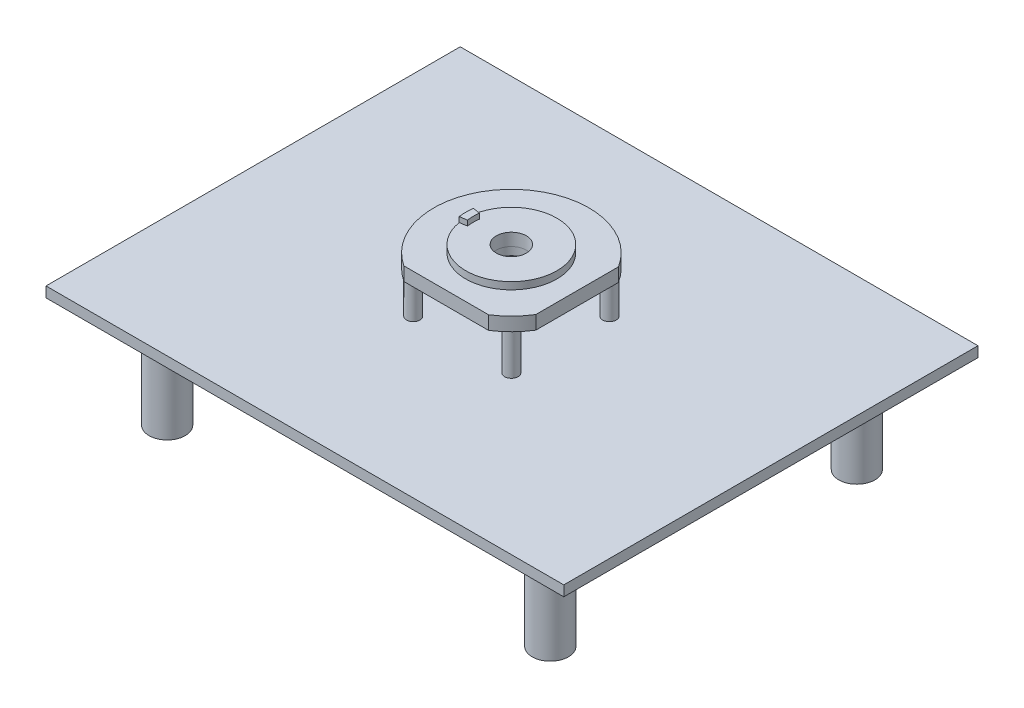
ISO-10303-21;
HEADER;
FILE_DESCRIPTION(('STEP AP214'),'2;1');
FILE_NAME('part.step','',(''),(''),'','','');
FILE_SCHEMA(('AUTOMOTIVE_DESIGN { 1 0 10303 214 1 1 1 1 }'));
ENDSEC;
DATA;
#1=APPLICATION_CONTEXT('core data for automotive mechanical design processes');
#2=APPLICATION_PROTOCOL_DEFINITION('international standard','automotive_design',2000,#1);
#3=PRODUCT_CONTEXT('',#1,'mechanical');
#4=PRODUCT('Part','Part','',(#3));
#5=PRODUCT_RELATED_PRODUCT_CATEGORY('part','',(#4));
#6=PRODUCT_DEFINITION_FORMATION('','',#4);
#7=PRODUCT_DEFINITION_CONTEXT('part definition',#1,'design');
#8=PRODUCT_DEFINITION('design','',#6,#7);
#9=PRODUCT_DEFINITION_SHAPE('','',#8);
#10=(LENGTH_UNIT() NAMED_UNIT(*) SI_UNIT(.MILLI.,.METRE.));
#11=(NAMED_UNIT(*) PLANE_ANGLE_UNIT() SI_UNIT($,.RADIAN.));
#12=(NAMED_UNIT(*) SI_UNIT($,.STERADIAN.) SOLID_ANGLE_UNIT());
#13=UNCERTAINTY_MEASURE_WITH_UNIT(LENGTH_MEASURE(1.E-05),#10,'distance_accuracy_value','');
#14=(GEOMETRIC_REPRESENTATION_CONTEXT(3) GLOBAL_UNCERTAINTY_ASSIGNED_CONTEXT((#13)) GLOBAL_UNIT_ASSIGNED_CONTEXT((#10,
#11,#12)) REPRESENTATION_CONTEXT('',''));
#15=CARTESIAN_POINT('',(0.,0.,0.));
#16=DIRECTION('',(0.,0.,1.));
#17=DIRECTION('',(1.,0.,0.));
#18=AXIS2_PLACEMENT_3D('',#15,#16,#17);
#19=CARTESIAN_POINT('',(0.,50.,0.623845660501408));
#20=DIRECTION('',(0.,1.,0.));
#21=DIRECTION('',(-1.,0.,0.));
#22=AXIS2_PLACEMENT_3D('',#19,#20,#21);
#23=CYLINDRICAL_SURFACE('',#22,75.);
#24=CARTESIAN_POINT('',(0.,50.,0.623845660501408));
#25=DIRECTION('',(0.,-1.,0.));
#26=DIRECTION('',(1.,0.,0.));
#27=AXIS2_PLACEMENT_3D('',#24,#25,#26);
#28=CIRCLE('',#27,75.);
#29=CARTESIAN_POINT('',(63.5,50.,40.5331177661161));
#30=VERTEX_POINT('',#29);
#31=CARTESIAN_POINT('',(40.8850732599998,50.,63.5));
#32=VERTEX_POINT('',#31);
#33=EDGE_CURVE('E195',#30,#32,#28,.T.);
#34=ORIENTED_EDGE('',*,*,#33,.F.);
#35=DIRECTION('',(0.,1.,0.));
#36=VECTOR('',#35,1.);
#37=CARTESIAN_POINT('',(63.5,50.,40.5331177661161));
#38=LINE('',#37,#36);
#39=CARTESIAN_POINT('',(63.5,63.08,40.5331177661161));
#40=VERTEX_POINT('',#39);
#41=EDGE_CURVE('E56',#30,#40,#38,.T.);
#42=ORIENTED_EDGE('',*,*,#41,.T.);
#43=CARTESIAN_POINT('',(0.,63.08,0.623845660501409));
#44=DIRECTION('',(0.,-1.,0.));
#45=DIRECTION('',(0.,0.,-1.));
#46=AXIS2_PLACEMENT_3D('',#43,#44,#45);
#47=CIRCLE('',#46,75.);
#48=CARTESIAN_POINT('',(40.8850732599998,63.08,63.5));
#49=VERTEX_POINT('',#48);
#50=EDGE_CURVE('E194',#40,#49,#47,.T.);
#51=ORIENTED_EDGE('',*,*,#50,.T.);
#52=DIRECTION('',(0.,1.,0.));
#53=VECTOR('',#52,1.);
#54=CARTESIAN_POINT('',(40.8850732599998,50.,63.5));
#55=LINE('',#54,#53);
#56=EDGE_CURVE('E301',#49,#32,#55,.F.);
#57=ORIENTED_EDGE('',*,*,#56,.T.);
#58=EDGE_LOOP('',(#34,#42,#51,#57));
#59=FACE_BOUND('',#58,.T.);
#60=ADVANCED_FACE('F38',(#59),#23,.T.);
#61=CARTESIAN_POINT('',(14.5,58.,0.623845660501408));
#62=DIRECTION('',(0.,-1.,0.));
#63=DIRECTION('',(0.,0.,-1.));
#64=AXIS2_PLACEMENT_3D('',#61,#62,#63);
#65=PLANE('',#64);
#66=CARTESIAN_POINT('',(0.,58.,0.623845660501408));
#67=DIRECTION('',(0.,-1.,0.));
#68=DIRECTION('',(0.,0.,-1.));
#69=AXIS2_PLACEMENT_3D('',#66,#67,#68);
#70=CIRCLE('',#69,14.5);
#71=CARTESIAN_POINT('',(0.,58.,-13.8761543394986));
#72=VERTEX_POINT('',#71);
#73=EDGE_CURVE('E158',#72,#72,#70,.T.);
#74=ORIENTED_EDGE('',*,*,#73,.F.);
#75=EDGE_LOOP('',(#74));
#76=FACE_BOUND('',#75,.T.);
#77=CARTESIAN_POINT('',(0.,58.,0.623845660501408));
#78=DIRECTION('',(0.,1.,0.));
#79=DIRECTION('',(-1.,0.,0.));
#80=AXIS2_PLACEMENT_3D('',#77,#78,#79);
#81=CIRCLE('',#80,15.);
#82=CARTESIAN_POINT('',(-15.,58.,0.623845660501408));
#83=VERTEX_POINT('',#82);
#84=EDGE_CURVE('E178',#83,#83,#81,.T.);
#85=ORIENTED_EDGE('',*,*,#84,.F.);
#86=EDGE_LOOP('',(#85));
#87=FACE_BOUND('',#86,.T.);
#88=ADVANCED_FACE('F337',(#76,#87),#65,.T.);
#89=CARTESIAN_POINT('',(0.,58.,0.623845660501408));
#90=DIRECTION('',(0.,-1.,0.));
#91=DIRECTION('',(0.,0.,-1.));
#92=AXIS2_PLACEMENT_3D('',#89,#90,#91);
#93=CYLINDRICAL_SURFACE('',#92,44.);
#94=CARTESIAN_POINT('',(0.,70.,0.623845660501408));
#95=DIRECTION('',(0.,-1.,0.));
#96=DIRECTION('',(0.,0.,-1.));
#97=AXIS2_PLACEMENT_3D('',#94,#95,#96);
#98=CIRCLE('',#97,44.);
#99=CARTESIAN_POINT('',(-43.458286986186,70.,-6.25927080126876));
#100=VERTEX_POINT('',#99);
#101=CARTESIAN_POINT('',(-43.458286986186,70.,7.50696212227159));
#102=VERTEX_POINT('',#101);
#103=EDGE_CURVE('E138',#100,#102,#98,.T.);
#104=ORIENTED_EDGE('',*,*,#103,.T.);
#105=DIRECTION('',(0.,-1.,0.));
#106=VECTOR('',#105,1.);
#107=CARTESIAN_POINT('',(-43.458286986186,75.,7.50696212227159));
#108=LINE('',#107,#106);
#109=CARTESIAN_POINT('',(-43.458286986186,75.,7.50696212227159));
#110=VERTEX_POINT('',#109);
#111=EDGE_CURVE('E128',#110,#102,#108,.T.);
#112=ORIENTED_EDGE('',*,*,#111,.F.);
#113=CARTESIAN_POINT('',(0.,75.,0.623845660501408));
#114=DIRECTION('',(0.,1.,0.));
#115=DIRECTION('',(0.,0.,1.));
#116=AXIS2_PLACEMENT_3D('',#113,#114,#115);
#117=CIRCLE('',#116,44.);
#118=CARTESIAN_POINT('',(-43.458286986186,75.,-6.25927080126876));
#119=VERTEX_POINT('',#118);
#120=EDGE_CURVE('E279',#119,#110,#117,.T.);
#121=ORIENTED_EDGE('',*,*,#120,.F.);
#122=DIRECTION('',(0.,-1.,0.));
#123=VECTOR('',#122,1.);
#124=CARTESIAN_POINT('',(-43.458286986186,75.,-6.25927080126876));
#125=LINE('',#124,#123);
#126=EDGE_CURVE('E154',#119,#100,#125,.T.);
#127=ORIENTED_EDGE('',*,*,#126,.T.);
#128=EDGE_LOOP('',(#104,#112,#121,#127));
#129=FACE_BOUND('',#128,.T.);
#130=CARTESIAN_POINT('',(0.,63.08,0.623845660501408));
#131=DIRECTION('',(0.,-1.,0.));
#132=DIRECTION('',(0.,0.,-1.));
#133=AXIS2_PLACEMENT_3D('',#130,#131,#132);
#134=CIRCLE('',#133,44.);
#135=CARTESIAN_POINT('',(0.,63.08,-43.3761543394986));
#136=VERTEX_POINT('',#135);
#137=EDGE_CURVE('E42',#136,#136,#134,.T.);
#138=ORIENTED_EDGE('',*,*,#137,.F.);
#139=EDGE_LOOP('',(#138));
#140=FACE_BOUND('',#139,.T.);
#141=ADVANCED_FACE('F151',(#129,#140),#93,.T.);
#142=CARTESIAN_POINT('',(0.,58.,0.623845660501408));
#143=DIRECTION('',(0.,-1.,0.));
#144=DIRECTION('',(0.,0.,-1.));
#145=AXIS2_PLACEMENT_3D('',#142,#143,#144);
#146=CYLINDRICAL_SURFACE('',#145,14.5);
#147=ORIENTED_EDGE('',*,*,#73,.T.);
#148=EDGE_LOOP('',(#147));
#149=FACE_BOUND('',#148,.T.);
#150=CARTESIAN_POINT('',(0.,70.,0.623845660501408));
#151=DIRECTION('',(0.,-1.,0.));
#152=DIRECTION('',(0.,0.,-1.));
#153=AXIS2_PLACEMENT_3D('',#150,#151,#152);
#154=CIRCLE('',#153,14.5);
#155=CARTESIAN_POINT('',(0.,70.,-13.8761543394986));
#156=VERTEX_POINT('',#155);
#157=EDGE_CURVE('E155',#156,#156,#154,.T.);
#158=ORIENTED_EDGE('',*,*,#157,.F.);
#159=EDGE_LOOP('',(#158));
#160=FACE_BOUND('',#159,.T.);
#161=ADVANCED_FACE('F453',(#149,#160),#146,.F.);
#162=CARTESIAN_POINT('',(14.5,70.,0.623845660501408));
#163=DIRECTION('',(0.,1.,0.));
#164=DIRECTION('',(0.,0.,1.));
#165=AXIS2_PLACEMENT_3D('',#162,#163,#164);
#166=PLANE('',#165);
#167=DIRECTION('',(-0.987688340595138,0.,-0.156434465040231));
#168=VECTOR('',#167,1.);
#169=CARTESIAN_POINT('',(0.,70.,0.623845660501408));
#170=LINE('',#169,#168);
#171=CARTESIAN_POINT('',(-36.5444686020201,70.,-5.16422954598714));
#172=VERTEX_POINT('',#171);
#173=EDGE_CURVE('E171',#172,#100,#170,.T.);
#174=ORIENTED_EDGE('',*,*,#173,.F.);
#175=CARTESIAN_POINT('',(0.,70.,0.623845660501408));
#176=DIRECTION('',(0.,1.,0.));
#177=DIRECTION('',(0.,0.,1.));
#178=AXIS2_PLACEMENT_3D('',#175,#176,#177);
#179=CIRCLE('',#178,37.);
#180=CARTESIAN_POINT('',(-36.5444686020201,70.,6.41192086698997));
#181=VERTEX_POINT('',#180);
#182=EDGE_CURVE('E147',#172,#181,#179,.T.);
#183=ORIENTED_EDGE('',*,*,#182,.T.);
#184=DIRECTION('',(-0.987688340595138,0.,0.156434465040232));
#185=VECTOR('',#184,1.);
#186=CARTESIAN_POINT('',(0.,70.,0.623845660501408));
#187=LINE('',#186,#185);
#188=EDGE_CURVE('E131',#181,#102,#187,.T.);
#189=ORIENTED_EDGE('',*,*,#188,.T.);
#190=ORIENTED_EDGE('',*,*,#103,.F.);
#191=EDGE_LOOP('',(#174,#183,#189,#190));
#192=FACE_BOUND('',#191,.T.);
#193=ORIENTED_EDGE('',*,*,#157,.T.);
#194=EDGE_LOOP('',(#193));
#195=FACE_BOUND('',#194,.T.);
#196=ADVANCED_FACE('F144',(#192,#195),#166,.T.);
#197=CARTESIAN_POINT('',(0.,75.,0.623845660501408));
#198=DIRECTION('',(0.156434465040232,0.,0.987688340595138));
#199=DIRECTION('',(0.987688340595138,0.,-0.156434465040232));
#200=AXIS2_PLACEMENT_3D('',#197,#198,#199);
#201=PLANE('',#200);
#202=ORIENTED_EDGE('',*,*,#188,.F.);
#203=DIRECTION('',(0.,-1.,0.));
#204=VECTOR('',#203,1.);
#205=CARTESIAN_POINT('',(-36.5444686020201,75.,6.41192086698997));
#206=LINE('',#205,#204);
#207=CARTESIAN_POINT('',(-36.5444686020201,75.,6.41192086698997));
#208=VERTEX_POINT('',#207);
#209=EDGE_CURVE('E139',#208,#181,#206,.T.);
#210=ORIENTED_EDGE('',*,*,#209,.F.);
#211=DIRECTION('',(-0.987688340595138,0.,0.156434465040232));
#212=VECTOR('',#211,1.);
#213=CARTESIAN_POINT('',(0.,75.,0.623845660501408));
#214=LINE('',#213,#212);
#215=EDGE_CURVE('E134',#208,#110,#214,.T.);
#216=ORIENTED_EDGE('',*,*,#215,.T.);
#217=ORIENTED_EDGE('',*,*,#111,.T.);
#218=EDGE_LOOP('',(#202,#210,#216,#217));
#219=FACE_BOUND('',#218,.T.);
#220=ADVANCED_FACE('F130',(#219),#201,.T.);
#221=CARTESIAN_POINT('',(0.,75.,0.623845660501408));
#222=DIRECTION('',(0.,-1.,0.));
#223=DIRECTION('',(0.,0.,-1.));
#224=AXIS2_PLACEMENT_3D('',#221,#222,#223);
#225=CYLINDRICAL_SURFACE('',#224,37.);
#226=ORIENTED_EDGE('',*,*,#182,.F.);
#227=DIRECTION('',(0.,-1.,0.));
#228=VECTOR('',#227,1.);
#229=CARTESIAN_POINT('',(-36.5444686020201,75.,-5.16422954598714));
#230=LINE('',#229,#228);
#231=CARTESIAN_POINT('',(-36.5444686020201,75.,-5.16422954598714));
#232=VERTEX_POINT('',#231);
#233=EDGE_CURVE('E172',#232,#172,#230,.T.);
#234=ORIENTED_EDGE('',*,*,#233,.F.);
#235=CARTESIAN_POINT('',(0.,75.,0.623845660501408));
#236=DIRECTION('',(0.,1.,0.));
#237=DIRECTION('',(0.,0.,1.));
#238=AXIS2_PLACEMENT_3D('',#235,#236,#237);
#239=CIRCLE('',#238,37.);
#240=EDGE_CURVE('E281',#232,#208,#239,.T.);
#241=ORIENTED_EDGE('',*,*,#240,.T.);
#242=ORIENTED_EDGE('',*,*,#209,.T.);
#243=EDGE_LOOP('',(#226,#234,#241,#242));
#244=FACE_BOUND('',#243,.T.);
#245=ADVANCED_FACE('F445',(#244),#225,.F.);
#246=CARTESIAN_POINT('',(0.,75.,0.623845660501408));
#247=DIRECTION('',(-0.156434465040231,0.,0.987688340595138));
#248=DIRECTION('',(0.987688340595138,0.,0.156434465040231));
#249=AXIS2_PLACEMENT_3D('',#246,#247,#248);
#250=PLANE('',#249);
#251=ORIENTED_EDGE('',*,*,#173,.T.);
#252=ORIENTED_EDGE('',*,*,#126,.F.);
#253=DIRECTION('',(-0.987688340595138,0.,-0.156434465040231));
#254=VECTOR('',#253,1.);
#255=CARTESIAN_POINT('',(0.,75.,0.623845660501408));
#256=LINE('',#255,#254);
#257=EDGE_CURVE('E168',#232,#119,#256,.T.);
#258=ORIENTED_EDGE('',*,*,#257,.F.);
#259=ORIENTED_EDGE('',*,*,#233,.T.);
#260=EDGE_LOOP('',(#251,#252,#258,#259));
#261=FACE_BOUND('',#260,.T.);
#262=ADVANCED_FACE('F442',(#261),#250,.F.);
#263=CARTESIAN_POINT('',(0.,75.,0.623845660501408));
#264=DIRECTION('',(0.,1.,0.));
#265=DIRECTION('',(0.,0.,1.));
#266=AXIS2_PLACEMENT_3D('',#263,#264,#265);
#267=PLANE('',#266);
#268=ORIENTED_EDGE('',*,*,#120,.T.);
#269=ORIENTED_EDGE('',*,*,#215,.F.);
#270=ORIENTED_EDGE('',*,*,#240,.F.);
#271=ORIENTED_EDGE('',*,*,#257,.T.);
#272=EDGE_LOOP('',(#268,#269,#270,#271));
#273=FACE_BOUND('',#272,.T.);
#274=ADVANCED_FACE('F439',(#273),#267,.T.);
#275=CARTESIAN_POINT('',(0.,63.08,0.623845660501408));
#276=DIRECTION('',(0.,-1.,0.));
#277=DIRECTION('',(1.,0.,0.));
#278=AXIS2_PLACEMENT_3D('',#275,#276,#277);
#279=PLANE('',#278);
#280=ORIENTED_EDGE('',*,*,#50,.F.);
#281=DIRECTION('',(0.,0.,1.));
#282=VECTOR('',#281,1.);
#283=CARTESIAN_POINT('',(63.5,63.08,-50.8));
#284=LINE('',#283,#282);
#285=CARTESIAN_POINT('',(63.5,63.08,-39.2854264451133));
#286=VERTEX_POINT('',#285);
#287=EDGE_CURVE('E303',#286,#40,#284,.T.);
#288=ORIENTED_EDGE('',*,*,#287,.F.);
#289=CARTESIAN_POINT('',(0.,63.08,0.623845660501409));
#290=DIRECTION('',(0.,-1.,0.));
#291=DIRECTION('',(0.,0.,-1.));
#292=AXIS2_PLACEMENT_3D('',#289,#290,#291);
#293=CIRCLE('',#292,75.);
#294=CARTESIAN_POINT('',(-40.8850732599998,63.08,63.5));
#295=VERTEX_POINT('',#294);
#296=EDGE_CURVE('E200',#295,#286,#293,.T.);
#297=ORIENTED_EDGE('',*,*,#296,.F.);
#298=DIRECTION('',(-1.,0.,0.));
#299=VECTOR('',#298,1.);
#300=CARTESIAN_POINT('',(-50.8,63.08,63.5));
#301=LINE('',#300,#299);
#302=EDGE_CURVE('E299',#49,#295,#301,.T.);
#303=ORIENTED_EDGE('',*,*,#302,.F.);
#304=EDGE_LOOP('',(#280,#288,#297,#303));
#305=FACE_BOUND('',#304,.T.);
#306=ORIENTED_EDGE('',*,*,#137,.T.);
#307=EDGE_LOOP('',(#306));
#308=FACE_BOUND('',#307,.T.);
#309=ADVANCED_FACE('F40',(#305,#308),#279,.F.);
#310=CARTESIAN_POINT('',(0.,0.,0.));
#311=DIRECTION('',(0.,-1.,0.));
#312=DIRECTION('',(0.,0.,-1.));
#313=AXIS2_PLACEMENT_3D('',#310,#311,#312);
#314=PLANE('',#313);
#315=CARTESIAN_POINT('',(0.,0.,0.6238494));
#316=DIRECTION('',(0.,-1.,0.));
#317=DIRECTION('',(0.,0.,-1.));
#318=AXIS2_PLACEMENT_3D('',#315,#316,#317);
#319=CIRCLE('',#318,10.);
#320=CARTESIAN_POINT('',(0.,0.,-9.3761506));
#321=VERTEX_POINT('',#320);
#322=EDGE_CURVE('E226',#321,#321,#319,.T.);
#323=ORIENTED_EDGE('',*,*,#322,.F.);
#324=EDGE_LOOP('',(#323));
#325=FACE_BOUND('',#324,.T.);
#326=CARTESIAN_POINT('',(-185.,0.,148.));
#327=DIRECTION('',(0.,-1.,0.));
#328=DIRECTION('',(0.,0.,-1.));
#329=AXIS2_PLACEMENT_3D('',#326,#327,#328);
#330=CIRCLE('',#329,17.5);
#331=CARTESIAN_POINT('',(-185.,0.,130.5));
#332=VERTEX_POINT('',#331);
#333=EDGE_CURVE('E148',#332,#332,#330,.T.);
#334=ORIENTED_EDGE('',*,*,#333,.F.);
#335=EDGE_LOOP('',(#334));
#336=FACE_BOUND('',#335,.T.);
#337=CARTESIAN_POINT('',(-185.,0.,-148.));
#338=DIRECTION('',(0.,-1.,0.));
#339=DIRECTION('',(0.,0.,-1.));
#340=AXIS2_PLACEMENT_3D('',#337,#338,#339);
#341=CIRCLE('',#340,17.5);
#342=CARTESIAN_POINT('',(-185.,0.,-165.5));
#343=VERTEX_POINT('',#342);
#344=EDGE_CURVE('E247',#343,#343,#341,.T.);
#345=ORIENTED_EDGE('',*,*,#344,.F.);
#346=EDGE_LOOP('',(#345));
#347=FACE_BOUND('',#346,.T.);
#348=DIRECTION('',(0.,0.,1.));
#349=VECTOR('',#348,1.);
#350=CARTESIAN_POINT('',(-250.,0.,-200.));
#351=LINE('',#350,#349);
#352=CARTESIAN_POINT('',(-250.,0.,-200.));
#353=VERTEX_POINT('',#352);
#354=CARTESIAN_POINT('',(-250.,0.,200.));
#355=VERTEX_POINT('',#354);
#356=EDGE_CURVE('E251',#353,#355,#351,.T.);
#357=ORIENTED_EDGE('',*,*,#356,.F.);
#358=DIRECTION('',(-1.,0.,0.));
#359=VECTOR('',#358,1.);
#360=CARTESIAN_POINT('',(250.,0.,-200.));
#361=LINE('',#360,#359);
#362=CARTESIAN_POINT('',(250.,0.,-200.));
#363=VERTEX_POINT('',#362);
#364=EDGE_CURVE('E260',#363,#353,#361,.T.);
#365=ORIENTED_EDGE('',*,*,#364,.F.);
#366=DIRECTION('',(0.,0.,-1.));
#367=VECTOR('',#366,1.);
#368=CARTESIAN_POINT('',(250.,0.,-200.));
#369=LINE('',#368,#367);
#370=CARTESIAN_POINT('',(250.,0.,200.));
#371=VERTEX_POINT('',#370);
#372=EDGE_CURVE('E258',#371,#363,#369,.T.);
#373=ORIENTED_EDGE('',*,*,#372,.F.);
#374=DIRECTION('',(1.,0.,0.));
#375=VECTOR('',#374,1.);
#376=CARTESIAN_POINT('',(250.,0.,200.));
#377=LINE('',#376,#375);
#378=EDGE_CURVE('E256',#355,#371,#377,.T.);
#379=ORIENTED_EDGE('',*,*,#378,.F.);
#380=EDGE_LOOP('',(#357,#365,#373,#379));
#381=FACE_BOUND('',#380,.T.);
#382=CARTESIAN_POINT('',(185.,0.,-148.));
#383=DIRECTION('',(0.,-1.,0.));
#384=DIRECTION('',(0.,0.,-1.));
#385=AXIS2_PLACEMENT_3D('',#382,#383,#384);
#386=CIRCLE('',#385,17.5);
#387=CARTESIAN_POINT('',(185.,0.,-165.5));
#388=VERTEX_POINT('',#387);
#389=EDGE_CURVE('E274',#388,#388,#386,.T.);
#390=ORIENTED_EDGE('',*,*,#389,.F.);
#391=EDGE_LOOP('',(#390));
#392=FACE_BOUND('',#391,.T.);
#393=CARTESIAN_POINT('',(185.,0.,148.));
#394=DIRECTION('',(0.,-1.,0.));
#395=DIRECTION('',(0.,0.,1.));
#396=AXIS2_PLACEMENT_3D('',#393,#394,#395);
#397=CIRCLE('',#396,17.5);
#398=CARTESIAN_POINT('',(185.,0.,165.5));
#399=VERTEX_POINT('',#398);
#400=EDGE_CURVE('E238',#399,#399,#397,.T.);
#401=ORIENTED_EDGE('',*,*,#400,.F.);
#402=EDGE_LOOP('',(#401));
#403=FACE_BOUND('',#402,.T.);
#404=ADVANCED_FACE('F420',(#325,#336,#347,#381,#392,#403),#314,.T.);
#405=CARTESIAN_POINT('',(-250.,4.,-200.));
#406=DIRECTION('',(1.,0.,0.));
#407=DIRECTION('',(0.,0.,-1.));
#408=AXIS2_PLACEMENT_3D('',#405,#406,#407);
#409=PLANE('',#408);
#410=ORIENTED_EDGE('',*,*,#356,.T.);
#411=DIRECTION('',(0.,-1.,0.));
#412=VECTOR('',#411,1.);
#413=CARTESIAN_POINT('',(-250.,4.,200.));
#414=LINE('',#413,#412);
#415=CARTESIAN_POINT('',(-250.,10.,200.));
#416=VERTEX_POINT('',#415);
#417=EDGE_CURVE('E271',#416,#355,#414,.T.);
#418=ORIENTED_EDGE('',*,*,#417,.F.);
#419=DIRECTION('',(0.,0.,1.));
#420=VECTOR('',#419,1.);
#421=CARTESIAN_POINT('',(-250.,10.,-200.));
#422=LINE('',#421,#420);
#423=CARTESIAN_POINT('',(-250.,10.,-200.));
#424=VERTEX_POINT('',#423);
#425=EDGE_CURVE('E225',#424,#416,#422,.T.);
#426=ORIENTED_EDGE('',*,*,#425,.F.);
#427=DIRECTION('',(0.,-1.,0.));
#428=VECTOR('',#427,1.);
#429=CARTESIAN_POINT('',(-250.,4.,-200.));
#430=LINE('',#429,#428);
#431=EDGE_CURVE('E262',#424,#353,#430,.T.);
#432=ORIENTED_EDGE('',*,*,#431,.T.);
#433=EDGE_LOOP('',(#410,#418,#426,#432));
#434=FACE_BOUND('',#433,.T.);
#435=ADVANCED_FACE('F423',(#434),#409,.F.);
#436=CARTESIAN_POINT('',(250.,4.,200.));
#437=DIRECTION('',(0.,0.,-1.));
#438=DIRECTION('',(-1.,0.,0.));
#439=AXIS2_PLACEMENT_3D('',#436,#437,#438);
#440=PLANE('',#439);
#441=ORIENTED_EDGE('',*,*,#378,.T.);
#442=DIRECTION('',(0.,-1.,0.));
#443=VECTOR('',#442,1.);
#444=CARTESIAN_POINT('',(250.,4.,200.));
#445=LINE('',#444,#443);
#446=CARTESIAN_POINT('',(250.,10.,200.));
#447=VERTEX_POINT('',#446);
#448=EDGE_CURVE('E268',#447,#371,#445,.T.);
#449=ORIENTED_EDGE('',*,*,#448,.F.);
#450=DIRECTION('',(1.,0.,0.));
#451=VECTOR('',#450,1.);
#452=CARTESIAN_POINT('',(-250.,10.,200.));
#453=LINE('',#452,#451);
#454=EDGE_CURVE('E229',#416,#447,#453,.T.);
#455=ORIENTED_EDGE('',*,*,#454,.F.);
#456=ORIENTED_EDGE('',*,*,#417,.T.);
#457=EDGE_LOOP('',(#441,#449,#455,#456));
#458=FACE_BOUND('',#457,.T.);
#459=ADVANCED_FACE('F431',(#458),#440,.F.);
#460=CARTESIAN_POINT('',(250.,4.,-200.));
#461=DIRECTION('',(-1.,0.,0.));
#462=DIRECTION('',(0.,0.,1.));
#463=AXIS2_PLACEMENT_3D('',#460,#461,#462);
#464=PLANE('',#463);
#465=ORIENTED_EDGE('',*,*,#372,.T.);
#466=DIRECTION('',(0.,-1.,0.));
#467=VECTOR('',#466,1.);
#468=CARTESIAN_POINT('',(250.,4.,-200.));
#469=LINE('',#468,#467);
#470=CARTESIAN_POINT('',(250.,10.,-200.));
#471=VERTEX_POINT('',#470);
#472=EDGE_CURVE('E265',#471,#363,#469,.T.);
#473=ORIENTED_EDGE('',*,*,#472,.F.);
#474=DIRECTION('',(0.,0.,-1.));
#475=VECTOR('',#474,1.);
#476=CARTESIAN_POINT('',(250.,10.,200.));
#477=LINE('',#476,#475);
#478=EDGE_CURVE('E232',#447,#471,#477,.T.);
#479=ORIENTED_EDGE('',*,*,#478,.F.);
#480=ORIENTED_EDGE('',*,*,#448,.T.);
#481=EDGE_LOOP('',(#465,#473,#479,#480));
#482=FACE_BOUND('',#481,.T.);
#483=ADVANCED_FACE('F427',(#482),#464,.F.);
#484=CARTESIAN_POINT('',(250.,4.,-200.));
#485=DIRECTION('',(0.,0.,1.));
#486=DIRECTION('',(1.,0.,0.));
#487=AXIS2_PLACEMENT_3D('',#484,#485,#486);
#488=PLANE('',#487);
#489=ORIENTED_EDGE('',*,*,#364,.T.);
#490=ORIENTED_EDGE('',*,*,#431,.F.);
#491=DIRECTION('',(-1.,0.,0.));
#492=VECTOR('',#491,1.);
#493=CARTESIAN_POINT('',(250.,10.,-200.));
#494=LINE('',#493,#492);
#495=EDGE_CURVE('E222',#471,#424,#494,.T.);
#496=ORIENTED_EDGE('',*,*,#495,.F.);
#497=ORIENTED_EDGE('',*,*,#472,.T.);
#498=EDGE_LOOP('',(#489,#490,#496,#497));
#499=FACE_BOUND('',#498,.T.);
#500=ADVANCED_FACE('F418',(#499),#488,.F.);
#501=CARTESIAN_POINT('',(-185.,-100.,-148.));
#502=DIRECTION('',(0.,1.,0.));
#503=DIRECTION('',(0.,0.,1.));
#504=AXIS2_PLACEMENT_3D('',#501,#502,#503);
#505=CYLINDRICAL_SURFACE('',#504,17.5);
#506=CARTESIAN_POINT('',(-185.,-100.,-148.));
#507=DIRECTION('',(0.,-1.,0.));
#508=DIRECTION('',(0.,0.,-1.));
#509=AXIS2_PLACEMENT_3D('',#506,#507,#508);
#510=CIRCLE('',#509,17.5);
#511=CARTESIAN_POINT('',(-185.,-100.,-165.5));
#512=VERTEX_POINT('',#511);
#513=EDGE_CURVE('E248',#512,#512,#510,.T.);
#514=ORIENTED_EDGE('',*,*,#513,.F.);
#515=EDGE_LOOP('',(#514));
#516=FACE_BOUND('',#515,.T.);
#517=ORIENTED_EDGE('',*,*,#344,.T.);
#518=EDGE_LOOP('',(#517));
#519=FACE_BOUND('',#518,.T.);
#520=ADVANCED_FACE('F414',(#516,#519),#505,.T.);
#521=CARTESIAN_POINT('',(-185.,-100.,-148.));
#522=DIRECTION('',(0.,-1.,0.));
#523=DIRECTION('',(0.,0.,-1.));
#524=AXIS2_PLACEMENT_3D('',#521,#522,#523);
#525=PLANE('',#524);
#526=ORIENTED_EDGE('',*,*,#513,.T.);
#527=EDGE_LOOP('',(#526));
#528=FACE_BOUND('',#527,.T.);
#529=ADVANCED_FACE('F410',(#528),#525,.T.);
#530=CARTESIAN_POINT('',(185.,-100.,-148.));
#531=DIRECTION('',(0.,1.,0.));
#532=DIRECTION('',(0.,0.,1.));
#533=AXIS2_PLACEMENT_3D('',#530,#531,#532);
#534=CYLINDRICAL_SURFACE('',#533,17.5);
#535=CARTESIAN_POINT('',(185.,-100.,-148.));
#536=DIRECTION('',(0.,1.,0.));
#537=DIRECTION('',(0.,0.,-1.));
#538=AXIS2_PLACEMENT_3D('',#535,#536,#537);
#539=CIRCLE('',#538,17.5);
#540=CARTESIAN_POINT('',(185.,-100.,-165.5));
#541=VERTEX_POINT('',#540);
#542=EDGE_CURVE('E242',#541,#541,#539,.T.);
#543=ORIENTED_EDGE('',*,*,#542,.T.);
#544=EDGE_LOOP('',(#543));
#545=FACE_BOUND('',#544,.T.);
#546=ORIENTED_EDGE('',*,*,#389,.T.);
#547=EDGE_LOOP('',(#546));
#548=FACE_BOUND('',#547,.T.);
#549=ADVANCED_FACE('F406',(#545,#548),#534,.T.);
#550=CARTESIAN_POINT('',(185.,-100.,-148.));
#551=DIRECTION('',(0.,-1.,0.));
#552=DIRECTION('',(0.,0.,-1.));
#553=AXIS2_PLACEMENT_3D('',#550,#551,#552);
#554=PLANE('',#553);
#555=ORIENTED_EDGE('',*,*,#542,.F.);
#556=EDGE_LOOP('',(#555));
#557=FACE_BOUND('',#556,.T.);
#558=ADVANCED_FACE('F402',(#557),#554,.T.);
#559=CARTESIAN_POINT('',(185.,-100.,148.));
#560=DIRECTION('',(0.,1.,0.));
#561=DIRECTION('',(0.,0.,1.));
#562=AXIS2_PLACEMENT_3D('',#559,#560,#561);
#563=CYLINDRICAL_SURFACE('',#562,17.5);
#564=CARTESIAN_POINT('',(185.,-100.,148.));
#565=DIRECTION('',(0.,-1.,0.));
#566=DIRECTION('',(0.,0.,1.));
#567=AXIS2_PLACEMENT_3D('',#564,#565,#566);
#568=CIRCLE('',#567,17.5);
#569=CARTESIAN_POINT('',(185.,-100.,165.5));
#570=VERTEX_POINT('',#569);
#571=EDGE_CURVE('E239',#570,#570,#568,.T.);
#572=ORIENTED_EDGE('',*,*,#571,.F.);
#573=EDGE_LOOP('',(#572));
#574=FACE_BOUND('',#573,.T.);
#575=ORIENTED_EDGE('',*,*,#400,.T.);
#576=EDGE_LOOP('',(#575));
#577=FACE_BOUND('',#576,.T.);
#578=ADVANCED_FACE('F398',(#574,#577),#563,.T.);
#579=CARTESIAN_POINT('',(185.,-100.,148.));
#580=DIRECTION('',(0.,-1.,0.));
#581=DIRECTION('',(0.,0.,1.));
#582=AXIS2_PLACEMENT_3D('',#579,#580,#581);
#583=PLANE('',#582);
#584=ORIENTED_EDGE('',*,*,#571,.T.);
#585=EDGE_LOOP('',(#584));
#586=FACE_BOUND('',#585,.T.);
#587=ADVANCED_FACE('F394',(#586),#583,.T.);
#588=CARTESIAN_POINT('',(-185.,-100.,148.));
#589=DIRECTION('',(0.,1.,0.));
#590=DIRECTION('',(0.,0.,1.));
#591=AXIS2_PLACEMENT_3D('',#588,#589,#590);
#592=CYLINDRICAL_SURFACE('',#591,17.5);
#593=CARTESIAN_POINT('',(-185.,-100.,148.));
#594=DIRECTION('',(0.,1.,0.));
#595=DIRECTION('',(0.,0.,1.));
#596=AXIS2_PLACEMENT_3D('',#593,#594,#595);
#597=CIRCLE('',#596,17.5);
#598=CARTESIAN_POINT('',(-185.,-100.,165.5));
#599=VERTEX_POINT('',#598);
#600=EDGE_CURVE('E235',#599,#599,#597,.T.);
#601=ORIENTED_EDGE('',*,*,#600,.T.);
#602=EDGE_LOOP('',(#601));
#603=FACE_BOUND('',#602,.T.);
#604=ORIENTED_EDGE('',*,*,#333,.T.);
#605=EDGE_LOOP('',(#604));
#606=FACE_BOUND('',#605,.T.);
#607=ADVANCED_FACE('F390',(#603,#606),#592,.T.);
#608=CARTESIAN_POINT('',(-185.,-100.,148.));
#609=DIRECTION('',(0.,-1.,0.));
#610=DIRECTION('',(0.,0.,1.));
#611=AXIS2_PLACEMENT_3D('',#608,#609,#610);
#612=PLANE('',#611);
#613=ORIENTED_EDGE('',*,*,#600,.F.);
#614=EDGE_LOOP('',(#613));
#615=FACE_BOUND('',#614,.T.);
#616=ADVANCED_FACE('F386',(#615),#612,.T.);
#617=CARTESIAN_POINT('',(0.,10.,0.));
#618=DIRECTION('',(0.,1.,0.));
#619=DIRECTION('',(0.,0.,1.));
#620=AXIS2_PLACEMENT_3D('',#617,#618,#619);
#621=PLANE('',#620);
#622=CARTESIAN_POINT('',(47.3761543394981,10.,48.0000000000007));
#623=DIRECTION('',(0.,-1.,0.));
#624=DIRECTION('',(0.,0.,-1.));
#625=AXIS2_PLACEMENT_3D('',#622,#623,#624);
#626=CIRCLE('',#625,6.5);
#627=CARTESIAN_POINT('',(47.3761543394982,10.,41.5000000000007));
#628=VERTEX_POINT('',#627);
#629=EDGE_CURVE('E218',#628,#628,#626,.T.);
#630=ORIENTED_EDGE('',*,*,#629,.T.);
#631=EDGE_LOOP('',(#630));
#632=FACE_BOUND('',#631,.T.);
#633=CARTESIAN_POINT('',(47.3761543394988,10.,-46.7523086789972));
#634=DIRECTION('',(0.,-1.,0.));
#635=DIRECTION('',(-1.,0.,0.));
#636=AXIS2_PLACEMENT_3D('',#633,#634,#635);
#637=CIRCLE('',#636,6.5);
#638=CARTESIAN_POINT('',(40.8761543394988,10.,-46.7523086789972));
#639=VERTEX_POINT('',#638);
#640=EDGE_CURVE('E215',#639,#639,#637,.T.);
#641=ORIENTED_EDGE('',*,*,#640,.T.);
#642=EDGE_LOOP('',(#641));
#643=FACE_BOUND('',#642,.T.);
#644=CARTESIAN_POINT('',(-47.3761543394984,10.,-46.7523086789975));
#645=DIRECTION('',(0.,-1.,0.));
#646=DIRECTION('',(0.,0.,1.));
#647=AXIS2_PLACEMENT_3D('',#644,#645,#646);
#648=CIRCLE('',#647,6.5);
#649=CARTESIAN_POINT('',(-47.3761543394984,10.,-40.2523086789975));
#650=VERTEX_POINT('',#649);
#651=EDGE_CURVE('E209',#650,#650,#648,.T.);
#652=ORIENTED_EDGE('',*,*,#651,.T.);
#653=EDGE_LOOP('',(#652));
#654=FACE_BOUND('',#653,.T.);
#655=CARTESIAN_POINT('',(-47.3761543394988,10.,48.));
#656=DIRECTION('',(0.,-1.,0.));
#657=DIRECTION('',(1.,0.,0.));
#658=AXIS2_PLACEMENT_3D('',#655,#656,#657);
#659=CIRCLE('',#658,6.5);
#660=CARTESIAN_POINT('',(-40.8761543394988,10.,48.));
#661=VERTEX_POINT('',#660);
#662=EDGE_CURVE('E189',#661,#661,#659,.T.);
#663=ORIENTED_EDGE('',*,*,#662,.T.);
#664=EDGE_LOOP('',(#663));
#665=FACE_BOUND('',#664,.T.);
#666=CARTESIAN_POINT('',(0.,10.,0.623849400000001));
#667=DIRECTION('',(0.,1.,0.));
#668=DIRECTION('',(0.,0.,1.));
#669=AXIS2_PLACEMENT_3D('',#666,#667,#668);
#670=CIRCLE('',#669,10.);
#671=CARTESIAN_POINT('',(0.,10.,10.6238494));
#672=VERTEX_POINT('',#671);
#673=EDGE_CURVE('E221',#672,#672,#670,.T.);
#674=ORIENTED_EDGE('',*,*,#673,.F.);
#675=EDGE_LOOP('',(#674));
#676=FACE_BOUND('',#675,.T.);
#677=ORIENTED_EDGE('',*,*,#495,.T.);
#678=ORIENTED_EDGE('',*,*,#425,.T.);
#679=ORIENTED_EDGE('',*,*,#454,.T.);
#680=ORIENTED_EDGE('',*,*,#478,.T.);
#681=EDGE_LOOP('',(#677,#678,#679,#680));
#682=FACE_BOUND('',#681,.T.);
#683=ADVANCED_FACE('F316',(#632,#643,#654,#665,#676,#682),#621,.T.);
#684=CARTESIAN_POINT('',(0.,-100.,0.623849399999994));
#685=DIRECTION('',(0.,1.,0.));
#686=DIRECTION('',(0.,0.,1.));
#687=AXIS2_PLACEMENT_3D('',#684,#685,#686);
#688=CYLINDRICAL_SURFACE('',#687,10.);
#689=ORIENTED_EDGE('',*,*,#322,.T.);
#690=EDGE_LOOP('',(#689));
#691=FACE_BOUND('',#690,.T.);
#692=ORIENTED_EDGE('',*,*,#673,.T.);
#693=EDGE_LOOP('',(#692));
#694=FACE_BOUND('',#693,.T.);
#695=ADVANCED_FACE('F372',(#691,#694),#688,.F.);
#696=CARTESIAN_POINT('',(47.3761543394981,10.,48.0000000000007));
#697=DIRECTION('',(0.,1.,0.));
#698=DIRECTION('',(-1.,0.,0.));
#699=AXIS2_PLACEMENT_3D('',#696,#697,#698);
#700=CYLINDRICAL_SURFACE('',#699,6.5);
#701=ORIENTED_EDGE('',*,*,#629,.F.);
#702=EDGE_LOOP('',(#701));
#703=FACE_BOUND('',#702,.T.);
#704=CARTESIAN_POINT('',(47.3761543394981,50.,48.0000000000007));
#705=DIRECTION('',(0.,-1.,0.));
#706=DIRECTION('',(0.,0.,-1.));
#707=AXIS2_PLACEMENT_3D('',#704,#705,#706);
#708=CIRCLE('',#707,6.5);
#709=CARTESIAN_POINT('',(47.3761543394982,50.,41.5000000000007));
#710=VERTEX_POINT('',#709);
#711=EDGE_CURVE('E206',#710,#710,#708,.T.);
#712=ORIENTED_EDGE('',*,*,#711,.T.);
#713=EDGE_LOOP('',(#712));
#714=FACE_BOUND('',#713,.T.);
#715=ADVANCED_FACE('F370',(#703,#714),#700,.T.);
#716=CARTESIAN_POINT('',(47.3761543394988,10.,-46.7523086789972));
#717=DIRECTION('',(0.,1.,0.));
#718=DIRECTION('',(-1.,0.,0.));
#719=AXIS2_PLACEMENT_3D('',#716,#717,#718);
#720=CYLINDRICAL_SURFACE('',#719,6.5);
#721=ORIENTED_EDGE('',*,*,#640,.F.);
#722=EDGE_LOOP('',(#721));
#723=FACE_BOUND('',#722,.T.);
#724=CARTESIAN_POINT('',(47.3761543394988,50.,-46.7523086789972));
#725=DIRECTION('',(0.,-1.,0.));
#726=DIRECTION('',(-1.,0.,0.));
#727=AXIS2_PLACEMENT_3D('',#724,#725,#726);
#728=CIRCLE('',#727,6.5);
#729=CARTESIAN_POINT('',(40.8761543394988,50.,-46.7523086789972));
#730=VERTEX_POINT('',#729);
#731=EDGE_CURVE('E203',#730,#730,#728,.T.);
#732=ORIENTED_EDGE('',*,*,#731,.T.);
#733=EDGE_LOOP('',(#732));
#734=FACE_BOUND('',#733,.T.);
#735=ADVANCED_FACE('F351',(#723,#734),#720,.T.);
#736=CARTESIAN_POINT('',(-47.3761543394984,10.,-46.7523086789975));
#737=DIRECTION('',(0.,1.,0.));
#738=DIRECTION('',(-1.,0.,0.));
#739=AXIS2_PLACEMENT_3D('',#736,#737,#738);
#740=CYLINDRICAL_SURFACE('',#739,6.5);
#741=ORIENTED_EDGE('',*,*,#651,.F.);
#742=EDGE_LOOP('',(#741));
#743=FACE_BOUND('',#742,.T.);
#744=CARTESIAN_POINT('',(-47.3761543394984,50.,-46.7523086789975));
#745=DIRECTION('',(0.,-1.,0.));
#746=DIRECTION('',(0.,0.,1.));
#747=AXIS2_PLACEMENT_3D('',#744,#745,#746);
#748=CIRCLE('',#747,6.5);
#749=CARTESIAN_POINT('',(-47.3761543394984,50.,-40.2523086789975));
#750=VERTEX_POINT('',#749);
#751=EDGE_CURVE('E199',#750,#750,#748,.T.);
#752=ORIENTED_EDGE('',*,*,#751,.T.);
#753=EDGE_LOOP('',(#752));
#754=FACE_BOUND('',#753,.T.);
#755=ADVANCED_FACE('F347',(#743,#754),#740,.T.);
#756=ORIENTED_EDGE('',*,*,#296,.T.);
#757=DIRECTION('',(0.,1.,0.));
#758=VECTOR('',#757,1.);
#759=CARTESIAN_POINT('',(63.5,50.,-39.2854264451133));
#760=LINE('',#759,#758);
#761=CARTESIAN_POINT('',(63.5,50.,-39.2854264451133));
#762=VERTEX_POINT('',#761);
#763=EDGE_CURVE('E74',#286,#762,#760,.F.);
#764=ORIENTED_EDGE('',*,*,#763,.T.);
#765=CARTESIAN_POINT('',(-40.8850732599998,50.,63.5));
#766=VERTEX_POINT('',#765);
#767=EDGE_CURVE('E191',#766,#762,#28,.T.);
#768=ORIENTED_EDGE('',*,*,#767,.F.);
#769=DIRECTION('',(0.,1.,0.));
#770=VECTOR('',#769,1.);
#771=CARTESIAN_POINT('',(-40.8850732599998,50.,63.5));
#772=LINE('',#771,#770);
#773=EDGE_CURVE('E310',#766,#295,#772,.T.);
#774=ORIENTED_EDGE('',*,*,#773,.T.);
#775=EDGE_LOOP('',(#756,#764,#768,#774));
#776=FACE_BOUND('',#775,.T.);
#777=ADVANCED_FACE('F332',(#776),#23,.T.);
#778=CARTESIAN_POINT('',(0.,50.,0.623845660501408));
#779=DIRECTION('',(0.,-1.,0.));
#780=DIRECTION('',(1.,0.,0.));
#781=AXIS2_PLACEMENT_3D('',#778,#779,#780);
#782=PLANE('',#781);
#783=DIRECTION('',(0.,0.,-1.));
#784=VECTOR('',#783,1.);
#785=CARTESIAN_POINT('',(63.5,50.,0.623845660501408));
#786=LINE('',#785,#784);
#787=EDGE_CURVE('E12',#30,#762,#786,.T.);
#788=ORIENTED_EDGE('',*,*,#787,.F.);
#789=ORIENTED_EDGE('',*,*,#33,.T.);
#790=DIRECTION('',(1.,0.,0.));
#791=VECTOR('',#790,1.);
#792=CARTESIAN_POINT('',(0.,50.,63.5));
#793=LINE('',#792,#791);
#794=EDGE_CURVE('E48',#766,#32,#793,.T.);
#795=ORIENTED_EDGE('',*,*,#794,.F.);
#796=ORIENTED_EDGE('',*,*,#767,.T.);
#797=EDGE_LOOP('',(#788,#789,#795,#796));
#798=FACE_BOUND('',#797,.T.);
#799=CARTESIAN_POINT('',(0.,50.,0.623845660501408));
#800=DIRECTION('',(0.,-1.,0.));
#801=DIRECTION('',(1.,0.,0.));
#802=AXIS2_PLACEMENT_3D('',#799,#800,#801);
#803=CIRCLE('',#802,15.);
#804=CARTESIAN_POINT('',(15.,50.,0.623845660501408));
#805=VERTEX_POINT('',#804);
#806=EDGE_CURVE('E210',#805,#805,#803,.T.);
#807=ORIENTED_EDGE('',*,*,#806,.F.);
#808=EDGE_LOOP('',(#807));
#809=FACE_BOUND('',#808,.T.);
#810=ORIENTED_EDGE('',*,*,#731,.F.);
#811=EDGE_LOOP('',(#810));
#812=FACE_BOUND('',#811,.T.);
#813=CARTESIAN_POINT('',(-47.3761543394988,50.,48.));
#814=DIRECTION('',(0.,-1.,0.));
#815=DIRECTION('',(1.,0.,0.));
#816=AXIS2_PLACEMENT_3D('',#813,#814,#815);
#817=CIRCLE('',#816,6.5);
#818=CARTESIAN_POINT('',(-40.8761543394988,50.,48.));
#819=VERTEX_POINT('',#818);
#820=EDGE_CURVE('E196',#819,#819,#817,.T.);
#821=ORIENTED_EDGE('',*,*,#820,.F.);
#822=EDGE_LOOP('',(#821));
#823=FACE_BOUND('',#822,.T.);
#824=ORIENTED_EDGE('',*,*,#751,.F.);
#825=EDGE_LOOP('',(#824));
#826=FACE_BOUND('',#825,.T.);
#827=ORIENTED_EDGE('',*,*,#711,.F.);
#828=EDGE_LOOP('',(#827));
#829=FACE_BOUND('',#828,.T.);
#830=ADVANCED_FACE('F322',(#798,#809,#812,#823,#826,#829),#782,.T.);
#831=CARTESIAN_POINT('',(-47.3761543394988,10.,48.));
#832=DIRECTION('',(0.,1.,0.));
#833=DIRECTION('',(-1.,0.,0.));
#834=AXIS2_PLACEMENT_3D('',#831,#832,#833);
#835=CYLINDRICAL_SURFACE('',#834,6.5);
#836=ORIENTED_EDGE('',*,*,#820,.T.);
#837=EDGE_LOOP('',(#836));
#838=FACE_BOUND('',#837,.T.);
#839=ORIENTED_EDGE('',*,*,#662,.F.);
#840=EDGE_LOOP('',(#839));
#841=FACE_BOUND('',#840,.T.);
#842=ADVANCED_FACE('F319',(#838,#841),#835,.T.);
#843=CARTESIAN_POINT('',(0.,10.,0.623845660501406));
#844=DIRECTION('',(0.,1.,0.));
#845=DIRECTION('',(-1.,0.,0.));
#846=AXIS2_PLACEMENT_3D('',#843,#844,#845);
#847=CYLINDRICAL_SURFACE('',#846,15.);
#848=ORIENTED_EDGE('',*,*,#806,.T.);
#849=EDGE_LOOP('',(#848));
#850=FACE_BOUND('',#849,.T.);
#851=ORIENTED_EDGE('',*,*,#84,.T.);
#852=EDGE_LOOP('',(#851));
#853=FACE_BOUND('',#852,.T.);
#854=ADVANCED_FACE('F321',(#850,#853),#847,.F.);
#855=CARTESIAN_POINT('',(-50.8,-63.5922532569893,63.5));
#856=DIRECTION('',(0.,0.,-1.));
#857=DIRECTION('',(-1.,0.,0.));
#858=AXIS2_PLACEMENT_3D('',#855,#856,#857);
#859=PLANE('',#858);
#860=ORIENTED_EDGE('',*,*,#794,.T.);
#861=ORIENTED_EDGE('',*,*,#56,.F.);
#862=ORIENTED_EDGE('',*,*,#302,.T.);
#863=ORIENTED_EDGE('',*,*,#773,.F.);
#864=EDGE_LOOP('',(#860,#861,#862,#863));
#865=FACE_BOUND('',#864,.T.);
#866=ADVANCED_FACE('F329',(#865),#859,.F.);
#867=CARTESIAN_POINT('',(63.5,-63.5922532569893,-50.8));
#868=DIRECTION('',(-1.,0.,0.));
#869=DIRECTION('',(0.,-1.,0.));
#870=AXIS2_PLACEMENT_3D('',#867,#868,#869);
#871=PLANE('',#870);
#872=ORIENTED_EDGE('',*,*,#787,.T.);
#873=ORIENTED_EDGE('',*,*,#763,.F.);
#874=ORIENTED_EDGE('',*,*,#287,.T.);
#875=ORIENTED_EDGE('',*,*,#41,.F.);
#876=EDGE_LOOP('',(#872,#873,#874,#875));
#877=FACE_BOUND('',#876,.T.);
#878=ADVANCED_FACE('F571',(#877),#871,.F.);
#879=CLOSED_SHELL('',(#60,#88,#141,#161,#196,#220,#245,#262,#274,#309,#404,#435,#459,#483,#500,
#520,#529,#549,#558,#578,#587,#607,#616,#683,#695,#715,#735,#755,#777,#830,#842,#854,#866,#878));
#880=MANIFOLD_SOLID_BREP('B2',#879);
#881=ADVANCED_BREP_SHAPE_REPRESENTATION('',(#18,#880),#14);
#882=SHAPE_DEFINITION_REPRESENTATION(#9,#881);
ENDSEC;
END-ISO-10303-21;
